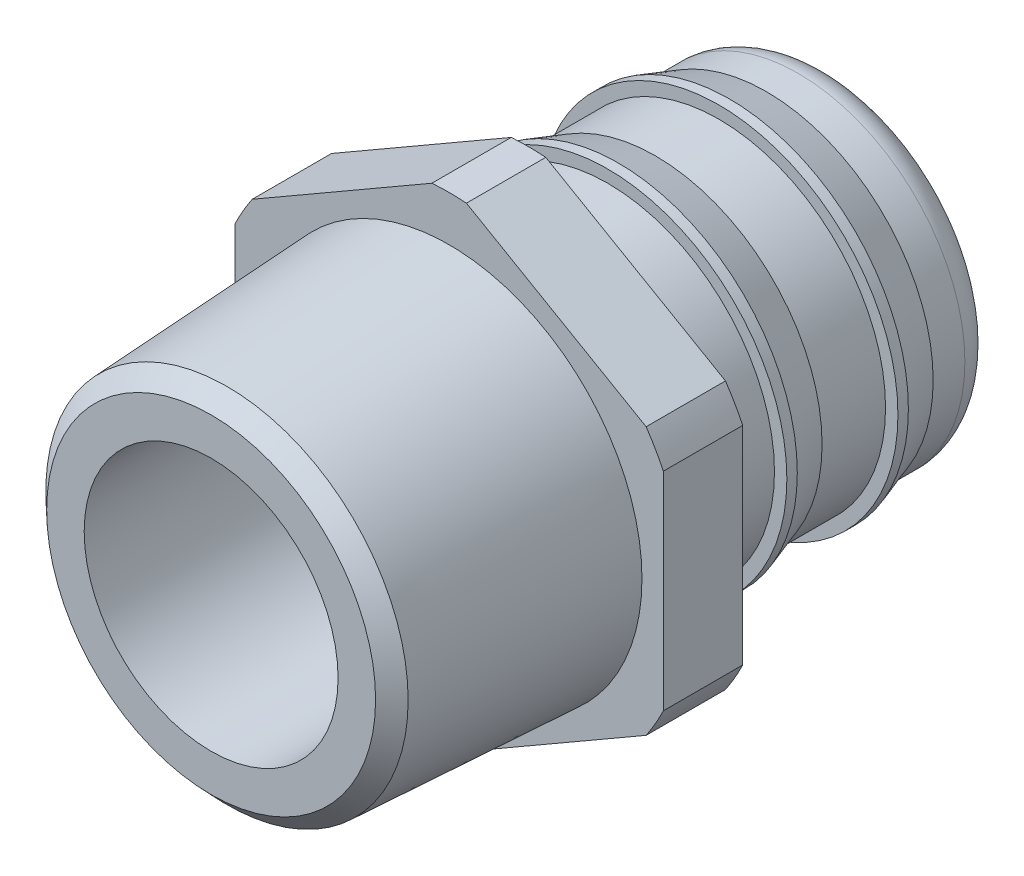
from build123d import *

# Parameters (mm, degrees)
ENL_V_MAT_EXTRU_1_DEPTH = 30.154759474


with BuildPart() as part:
    # Esquisse1 → R_volution1 (revolve)
    with BuildSketch(Plane(origin=(0, 0, 0), x_dir=(0, 0, -1), z_dir=(1, 0, 0)), mode=Mode.PRIVATE) as r_volution1_sk:
        with BuildLine():
            Line((10, 8), (10, 10.363883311))
            Line((10, 10.363883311), (10.998629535, 11.416219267))
            Line((10.998629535, 11.416219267), (25, 12.15))
            Line((25, 12.15), (25, 15))
            Line((25, 15), (30, 15))
            Line((30, 15), (30, 10.5))
            Line((30, 10.5), (35, 10.5))
            Line((35, 10.5), (35, 11.280628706))
            Line((35, 11.280628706), (35.658113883, 11.280628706))
            Line((35.658113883, 11.280628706), (38, 10.5))
            Line((38, 10.5), (42, 10.5))
            Line((42, 10.5), (42, 11.280628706))
            Line((42, 11.280628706), (42.658113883, 11.280628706))
            Line((42.658113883, 11.280628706), (45.000000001, 10.5))
            Line((45.000000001, 10.5), (47, 10.5))
            ThreePointArc((47, 10.5), (48.414213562, 9.914213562), (49, 8.5))
            Line((49, 8.5), (49, 8))
            Line((49, 8), (10, 8))
        make_face()
    revolve(r_volution1_sk.sketch.rotate(Axis((0, 0, 0), (0, 0, -1)), 90), axis=Axis((0, 0, 0), (0, 0, -1)))

    # Esquisse2 → Enl_v. mat.-Extru.1 (cut, through all)
    with BuildSketch(Plane(origin=(0, 0, -30), x_dir=(-1, 0, 0), z_dir=(0, 0, -1))):
        with BuildLine():
            Line((13.5, -6.538348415), (13.5, 6.538348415))
            ThreePointArc((13.5, 6.538348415), (15, 0), (13.5, -6.538348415))
        make_face()
        with BuildLine():
            Line((12.412375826, 8.422168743), (1.087624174, 14.960517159))
            ThreePointArc((1.087624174, 14.960517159), (7.5, 12.990381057), (12.412375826, 8.422168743))
        make_face()
        with BuildLine():
            Line((-1.087624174, 14.960517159), (-12.412375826, 8.422168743))
            ThreePointArc((-12.412375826, 8.422168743), (-7.5, 12.990381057), (-1.087624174, 14.960517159))
        make_face()
        with BuildLine():
            Line((-13.5, 6.538348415), (-13.5, -6.538348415))
            ThreePointArc((-13.5, -6.538348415), (-15, 0), (-13.5, 6.538348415))
        make_face()
        with BuildLine():
            Line((-12.412375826, -8.422168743), (-1.087624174, -14.960517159))
            ThreePointArc((-1.087624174, -14.960517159), (-7.5, -12.990381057), (-12.412375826, -8.422168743))
        make_face()
        with BuildLine():
            Line((1.087624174, -14.960517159), (12.412375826, -8.422168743))
            ThreePointArc((12.412375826, -8.422168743), (7.5, -12.990381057), (1.087624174, -14.960517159))
        make_face()
    extrude(amount=-ENL_V_MAT_EXTRU_1_DEPTH, mode=Mode.SUBTRACT)


solid = part.part
